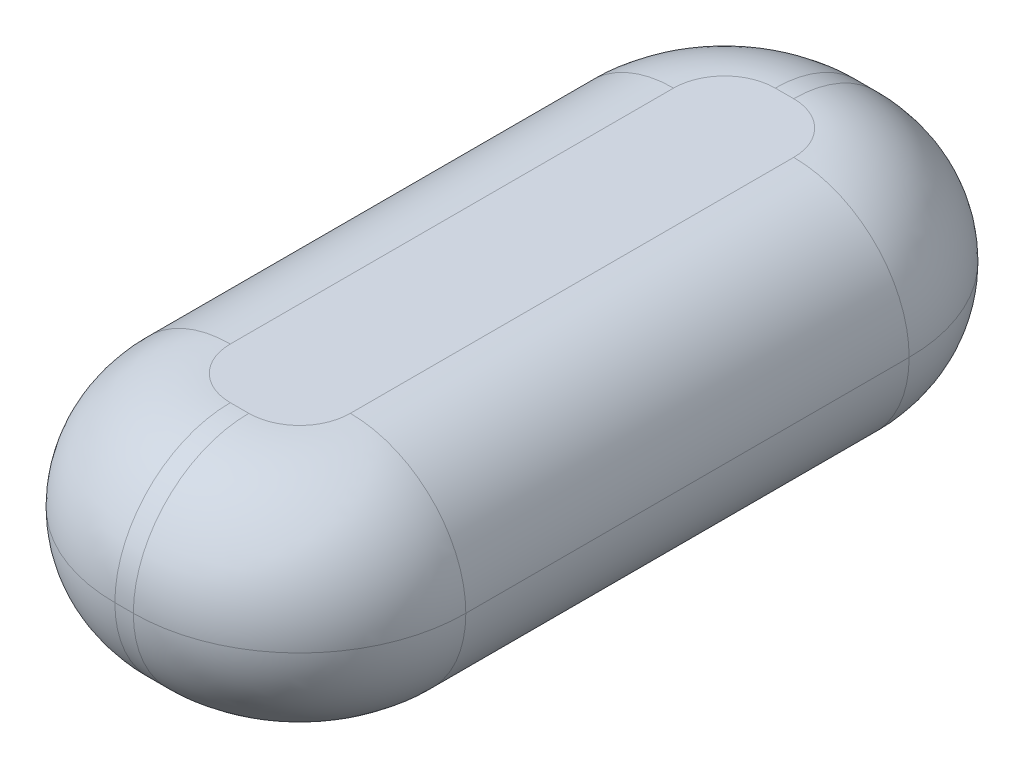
ISO-10303-21;
HEADER;
FILE_DESCRIPTION(('STEP AP214'),'2;1');
FILE_NAME('part.step','',(''),(''),'','','');
FILE_SCHEMA(('AUTOMOTIVE_DESIGN { 1 0 10303 214 1 1 1 1 }'));
ENDSEC;
DATA;
#1=APPLICATION_CONTEXT('core data for automotive mechanical design processes');
#2=APPLICATION_PROTOCOL_DEFINITION('international standard','automotive_design',2000,#1);
#3=PRODUCT_CONTEXT('',#1,'mechanical');
#4=PRODUCT('Part','Part','',(#3));
#5=PRODUCT_RELATED_PRODUCT_CATEGORY('part','',(#4));
#6=PRODUCT_DEFINITION_FORMATION('','',#4);
#7=PRODUCT_DEFINITION_CONTEXT('part definition',#1,'design');
#8=PRODUCT_DEFINITION('design','',#6,#7);
#9=PRODUCT_DEFINITION_SHAPE('','',#8);
#10=(LENGTH_UNIT() NAMED_UNIT(*) SI_UNIT(.MILLI.,.METRE.));
#11=(NAMED_UNIT(*) PLANE_ANGLE_UNIT() SI_UNIT($,.RADIAN.));
#12=(NAMED_UNIT(*) SI_UNIT($,.STERADIAN.) SOLID_ANGLE_UNIT());
#13=UNCERTAINTY_MEASURE_WITH_UNIT(LENGTH_MEASURE(1.E-05),#10,'distance_accuracy_value','');
#14=(GEOMETRIC_REPRESENTATION_CONTEXT(3) GLOBAL_UNCERTAINTY_ASSIGNED_CONTEXT((#13)) GLOBAL_UNIT_ASSIGNED_CONTEXT((#10,
#11,#12)) REPRESENTATION_CONTEXT('',''));
#15=CARTESIAN_POINT('',(0.,0.,0.));
#16=DIRECTION('',(0.,0.,1.));
#17=DIRECTION('',(1.,0.,0.));
#18=AXIS2_PLACEMENT_3D('',#15,#16,#17);
#19=CARTESIAN_POINT('',(-0.99999999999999,12.5,24.));
#20=DIRECTION('',(0.,1.,0.));
#21=DIRECTION('',(0.,0.,1.));
#22=AXIS2_PLACEMENT_3D('',#19,#20,#21);
#23=PLANE('',#22);
#24=CARTESIAN_POINT('',(-1.,12.5,-24.));
#25=DIRECTION('',(0.,1.,0.));
#26=DIRECTION('',(0.,0.,1.));
#27=AXIS2_PLACEMENT_3D('',#24,#25,#26);
#28=CIRCLE('',#27,5.49999999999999);
#29=CARTESIAN_POINT('',(-0.999999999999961,12.5,-29.5));
#30=VERTEX_POINT('',#29);
#31=CARTESIAN_POINT('',(-6.5,12.5,-23.9999999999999));
#32=VERTEX_POINT('',#31);
#33=EDGE_CURVE('E44',#30,#32,#28,.T.);
#34=ORIENTED_EDGE('',*,*,#33,.T.);
#35=DIRECTION('',(0.,0.,1.));
#36=VECTOR('',#35,1.);
#37=CARTESIAN_POINT('',(-6.49999999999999,12.5,23.9999999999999));
#38=LINE('',#37,#36);
#39=CARTESIAN_POINT('',(-6.49999999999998,12.5,23.9999999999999));
#40=VERTEX_POINT('',#39);
#41=EDGE_CURVE('E11',#32,#40,#38,.T.);
#42=ORIENTED_EDGE('',*,*,#41,.T.);
#43=CARTESIAN_POINT('',(-0.99999999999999,12.5,24.));
#44=DIRECTION('',(0.,1.,0.));
#45=DIRECTION('',(0.,0.,1.));
#46=AXIS2_PLACEMENT_3D('',#43,#44,#45);
#47=CIRCLE('',#46,5.49999999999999);
#48=CARTESIAN_POINT('',(-0.999999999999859,12.5,29.5));
#49=VERTEX_POINT('',#48);
#50=EDGE_CURVE('E211',#40,#49,#47,.T.);
#51=ORIENTED_EDGE('',*,*,#50,.T.);
#52=DIRECTION('',(1.,0.,0.));
#53=VECTOR('',#52,1.);
#54=CARTESIAN_POINT('',(0.999999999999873,12.5,29.5));
#55=LINE('',#54,#53);
#56=CARTESIAN_POINT('',(0.999999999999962,12.5,29.5));
#57=VERTEX_POINT('',#56);
#58=EDGE_CURVE('E209',#49,#57,#55,.T.);
#59=ORIENTED_EDGE('',*,*,#58,.T.);
#60=CARTESIAN_POINT('',(1.,12.5,24.));
#61=DIRECTION('',(0.,1.,0.));
#62=DIRECTION('',(0.,0.,1.));
#63=AXIS2_PLACEMENT_3D('',#60,#61,#62);
#64=CIRCLE('',#63,5.49999999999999);
#65=CARTESIAN_POINT('',(6.5,12.5,23.9999999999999));
#66=VERTEX_POINT('',#65);
#67=EDGE_CURVE('E207',#57,#66,#64,.T.);
#68=ORIENTED_EDGE('',*,*,#67,.T.);
#69=DIRECTION('',(0.,0.,-1.));
#70=VECTOR('',#69,1.);
#71=CARTESIAN_POINT('',(6.5,12.5,-23.9999999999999));
#72=LINE('',#71,#70);
#73=CARTESIAN_POINT('',(6.5,12.5,-24.));
#74=VERTEX_POINT('',#73);
#75=EDGE_CURVE('E135',#66,#74,#72,.T.);
#76=ORIENTED_EDGE('',*,*,#75,.T.);
#77=CARTESIAN_POINT('',(1.00000000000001,12.5,-24.));
#78=DIRECTION('',(0.,1.,0.));
#79=DIRECTION('',(0.,0.,1.));
#80=AXIS2_PLACEMENT_3D('',#77,#78,#79);
#81=CIRCLE('',#80,5.49999999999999);
#82=CARTESIAN_POINT('',(0.999999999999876,12.5,-29.5));
#83=VERTEX_POINT('',#82);
#84=EDGE_CURVE('E132',#74,#83,#81,.T.);
#85=ORIENTED_EDGE('',*,*,#84,.T.);
#86=DIRECTION('',(-1.,0.,0.));
#87=VECTOR('',#86,1.);
#88=CARTESIAN_POINT('',(-0.999999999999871,12.5,-29.5));
#89=LINE('',#88,#87);
#90=EDGE_CURVE('E133',#83,#30,#89,.T.);
#91=ORIENTED_EDGE('',*,*,#90,.T.);
#92=EDGE_LOOP('',(#34,#42,#51,#59,#68,#76,#85,#91));
#93=FACE_BOUND('',#92,.T.);
#94=ADVANCED_FACE('F34',(#93),#23,.T.);
#95=CARTESIAN_POINT('',(-0.99999999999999,-12.5,24.));
#96=DIRECTION('',(0.,1.,0.));
#97=DIRECTION('',(0.,0.,1.));
#98=AXIS2_PLACEMENT_3D('',#95,#96,#97);
#99=PLANE('',#98);
#100=CARTESIAN_POINT('',(1.,-12.5,24.));
#101=DIRECTION('',(0.,1.,0.));
#102=DIRECTION('',(0.,0.,1.));
#103=AXIS2_PLACEMENT_3D('',#100,#101,#102);
#104=CIRCLE('',#103,5.49999999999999);
#105=CARTESIAN_POINT('',(6.5,-12.5,24.));
#106=VERTEX_POINT('',#105);
#107=CARTESIAN_POINT('',(0.999999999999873,-12.5,29.5));
#108=VERTEX_POINT('',#107);
#109=EDGE_CURVE('E216',#106,#108,#104,.F.);
#110=ORIENTED_EDGE('',*,*,#109,.T.);
#111=DIRECTION('',(1.,0.,0.));
#112=VECTOR('',#111,1.);
#113=CARTESIAN_POINT('',(-0.99999999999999,-12.5,29.5));
#114=LINE('',#113,#112);
#115=CARTESIAN_POINT('',(-0.999999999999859,-12.5,29.5));
#116=VERTEX_POINT('',#115);
#117=EDGE_CURVE('E213',#108,#116,#114,.F.);
#118=ORIENTED_EDGE('',*,*,#117,.T.);
#119=CARTESIAN_POINT('',(-0.99999999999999,-12.5,24.));
#120=DIRECTION('',(0.,1.,0.));
#121=DIRECTION('',(0.,0.,1.));
#122=AXIS2_PLACEMENT_3D('',#119,#120,#121);
#123=CIRCLE('',#122,5.49999999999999);
#124=CARTESIAN_POINT('',(-6.49999999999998,-12.5,23.9999999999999));
#125=VERTEX_POINT('',#124);
#126=EDGE_CURVE('E146',#116,#125,#123,.F.);
#127=ORIENTED_EDGE('',*,*,#126,.T.);
#128=DIRECTION('',(0.,0.,1.));
#129=VECTOR('',#128,1.);
#130=CARTESIAN_POINT('',(-6.49999999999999,-12.5,24.));
#131=LINE('',#130,#129);
#132=CARTESIAN_POINT('',(-6.49999999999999,-12.5,-24.));
#133=VERTEX_POINT('',#132);
#134=EDGE_CURVE('E226',#125,#133,#131,.F.);
#135=ORIENTED_EDGE('',*,*,#134,.T.);
#136=CARTESIAN_POINT('',(-1.,-12.5,-24.));
#137=DIRECTION('',(0.,1.,0.));
#138=DIRECTION('',(0.,0.,1.));
#139=AXIS2_PLACEMENT_3D('',#136,#137,#138);
#140=CIRCLE('',#139,5.49999999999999);
#141=CARTESIAN_POINT('',(-0.999999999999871,-12.5,-29.5));
#142=VERTEX_POINT('',#141);
#143=EDGE_CURVE('E224',#133,#142,#140,.F.);
#144=ORIENTED_EDGE('',*,*,#143,.T.);
#145=DIRECTION('',(-1.,0.,0.));
#146=VECTOR('',#145,1.);
#147=CARTESIAN_POINT('',(-0.99999999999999,-12.5,-29.5));
#148=LINE('',#147,#146);
#149=CARTESIAN_POINT('',(0.999999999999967,-12.5,-29.5));
#150=VERTEX_POINT('',#149);
#151=EDGE_CURVE('E222',#142,#150,#148,.F.);
#152=ORIENTED_EDGE('',*,*,#151,.T.);
#153=CARTESIAN_POINT('',(1.00000000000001,-12.5,-24.));
#154=DIRECTION('',(0.,1.,0.));
#155=DIRECTION('',(0.,0.,1.));
#156=AXIS2_PLACEMENT_3D('',#153,#154,#155);
#157=CIRCLE('',#156,5.49999999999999);
#158=CARTESIAN_POINT('',(6.5,-12.5,-23.9999999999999));
#159=VERTEX_POINT('',#158);
#160=EDGE_CURVE('E220',#150,#159,#157,.F.);
#161=ORIENTED_EDGE('',*,*,#160,.T.);
#162=DIRECTION('',(0.,0.,-1.));
#163=VECTOR('',#162,1.);
#164=CARTESIAN_POINT('',(6.5,-12.5,24.));
#165=LINE('',#164,#163);
#166=EDGE_CURVE('E218',#159,#106,#165,.F.);
#167=ORIENTED_EDGE('',*,*,#166,.T.);
#168=EDGE_LOOP('',(#110,#118,#127,#135,#144,#152,#161,#167));
#169=FACE_BOUND('',#168,.T.);
#170=ADVANCED_FACE('F230',(#169),#99,.F.);
#171=CARTESIAN_POINT('',(-0.99999999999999,0.,-29.5));
#172=DIRECTION('',(1.,0.,0.));
#173=DIRECTION('',(0.,0.,-1.));
#174=AXIS2_PLACEMENT_3D('',#171,#172,#173);
#175=CYLINDRICAL_SURFACE('',#174,12.5);
#176=CARTESIAN_POINT('',(-0.999999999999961,0.,-29.5));
#177=DIRECTION('',(-1.,0.,0.));
#178=DIRECTION('',(0.,0.,1.));
#179=AXIS2_PLACEMENT_3D('',#176,#177,#178);
#180=CIRCLE('',#179,12.5);
#181=CARTESIAN_POINT('',(-0.999999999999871,0.,-42.));
#182=VERTEX_POINT('',#181);
#183=EDGE_CURVE('E38',#30,#182,#180,.T.);
#184=ORIENTED_EDGE('',*,*,#183,.F.);
#185=ORIENTED_EDGE('',*,*,#90,.F.);
#186=CARTESIAN_POINT('',(0.999999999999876,0.,-29.5));
#187=DIRECTION('',(1.,0.,0.));
#188=DIRECTION('',(0.,0.,-1.));
#189=AXIS2_PLACEMENT_3D('',#186,#187,#188);
#190=CIRCLE('',#189,12.5);
#191=CARTESIAN_POINT('',(0.999999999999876,0.,-42.));
#192=VERTEX_POINT('',#191);
#193=EDGE_CURVE('E80',#192,#83,#190,.T.);
#194=ORIENTED_EDGE('',*,*,#193,.F.);
#195=DIRECTION('',(-1.,0.,0.));
#196=VECTOR('',#195,1.);
#197=CARTESIAN_POINT('',(0.999999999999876,0.,-42.));
#198=LINE('',#197,#196);
#199=EDGE_CURVE('E145',#182,#192,#198,.F.);
#200=ORIENTED_EDGE('',*,*,#199,.F.);
#201=EDGE_LOOP('',(#184,#185,#194,#200));
#202=FACE_BOUND('',#201,.T.);
#203=ADVANCED_FACE('F36',(#202),#175,.T.);
#204=CARTESIAN_POINT('',(-1.,0.,-24.));
#205=DIRECTION('',(0.,1.,0.));
#206=DIRECTION('',(0.,0.,1.));
#207=AXIS2_PLACEMENT_3D('',#204,#205,#206);
#208=DEGENERATE_TOROIDAL_SURFACE('',#207,5.49999999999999,12.5,.T.);
#209=ORIENTED_EDGE('',*,*,#33,.F.);
#210=ORIENTED_EDGE('',*,*,#183,.T.);
#211=CARTESIAN_POINT('',(-1.,0.,-24.));
#212=DIRECTION('',(0.,1.,0.));
#213=DIRECTION('',(0.,0.,1.));
#214=AXIS2_PLACEMENT_3D('',#211,#212,#213);
#215=CIRCLE('',#214,18.);
#216=CARTESIAN_POINT('',(-19.,0.,-23.9999999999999));
#217=VERTEX_POINT('',#216);
#218=EDGE_CURVE('E152',#217,#182,#215,.F.);
#219=ORIENTED_EDGE('',*,*,#218,.F.);
#220=CARTESIAN_POINT('',(-6.5,0.,-23.9999999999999));
#221=DIRECTION('',(0.,0.,1.));
#222=DIRECTION('',(1.,0.,0.));
#223=AXIS2_PLACEMENT_3D('',#220,#221,#222);
#224=CIRCLE('',#223,12.5);
#225=EDGE_CURVE('E155',#32,#217,#224,.T.);
#226=ORIENTED_EDGE('',*,*,#225,.F.);
#227=EDGE_LOOP('',(#209,#210,#219,#226));
#228=FACE_BOUND('',#227,.T.);
#229=ADVANCED_FACE('F269',(#228),#208,.T.);
#230=CARTESIAN_POINT('',(1.00000000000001,0.,-24.));
#231=DIRECTION('',(0.,1.,0.));
#232=DIRECTION('',(0.,0.,1.));
#233=AXIS2_PLACEMENT_3D('',#230,#231,#232);
#234=DEGENERATE_TOROIDAL_SURFACE('',#233,5.49999999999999,12.5,.T.);
#235=ORIENTED_EDGE('',*,*,#193,.T.);
#236=ORIENTED_EDGE('',*,*,#84,.F.);
#237=CARTESIAN_POINT('',(6.5,0.,-24.));
#238=DIRECTION('',(0.,0.,1.));
#239=DIRECTION('',(1.,0.,0.));
#240=AXIS2_PLACEMENT_3D('',#237,#238,#239);
#241=CIRCLE('',#240,12.5);
#242=CARTESIAN_POINT('',(19.,0.,-23.9999999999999));
#243=VERTEX_POINT('',#242);
#244=EDGE_CURVE('E158',#243,#74,#241,.T.);
#245=ORIENTED_EDGE('',*,*,#244,.F.);
#246=CARTESIAN_POINT('',(1.00000000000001,0.,-24.));
#247=DIRECTION('',(0.,1.,0.));
#248=DIRECTION('',(0.,0.,1.));
#249=AXIS2_PLACEMENT_3D('',#246,#247,#248);
#250=CIRCLE('',#249,18.);
#251=EDGE_CURVE('E143',#192,#243,#250,.F.);
#252=ORIENTED_EDGE('',*,*,#251,.F.);
#253=EDGE_LOOP('',(#235,#236,#245,#252));
#254=FACE_BOUND('',#253,.T.);
#255=ADVANCED_FACE('F141',(#254),#234,.T.);
#256=CARTESIAN_POINT('',(-0.999999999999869,0.,-29.5));
#257=DIRECTION('',(-1.,0.,0.));
#258=DIRECTION('',(0.,0.,1.));
#259=AXIS2_PLACEMENT_3D('',#256,#257,#258);
#260=CYLINDRICAL_SURFACE('',#259,12.5);
#261=CARTESIAN_POINT('',(0.999999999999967,0.,-29.5));
#262=DIRECTION('',(1.,0.,0.));
#263=DIRECTION('',(0.,0.,-1.));
#264=AXIS2_PLACEMENT_3D('',#261,#262,#263);
#265=CIRCLE('',#264,12.5);
#266=EDGE_CURVE('E161',#150,#192,#265,.T.);
#267=ORIENTED_EDGE('',*,*,#266,.F.);
#268=ORIENTED_EDGE('',*,*,#151,.F.);
#269=CARTESIAN_POINT('',(-0.999999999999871,0.,-29.5));
#270=DIRECTION('',(-1.,0.,0.));
#271=DIRECTION('',(0.,0.,1.));
#272=AXIS2_PLACEMENT_3D('',#269,#270,#271);
#273=CIRCLE('',#272,12.5);
#274=EDGE_CURVE('E147',#182,#142,#273,.T.);
#275=ORIENTED_EDGE('',*,*,#274,.F.);
#276=ORIENTED_EDGE('',*,*,#199,.T.);
#277=EDGE_LOOP('',(#267,#268,#275,#276));
#278=FACE_BOUND('',#277,.T.);
#279=ADVANCED_FACE('F265',(#278),#260,.T.);
#280=CARTESIAN_POINT('',(-1.,0.,-24.));
#281=DIRECTION('',(0.,1.,0.));
#282=DIRECTION('',(0.,0.,1.));
#283=AXIS2_PLACEMENT_3D('',#280,#281,#282);
#284=DEGENERATE_TOROIDAL_SURFACE('',#283,5.49999999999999,12.5,.T.);
#285=ORIENTED_EDGE('',*,*,#274,.T.);
#286=ORIENTED_EDGE('',*,*,#143,.F.);
#287=CARTESIAN_POINT('',(-6.5,0.,-24.));
#288=DIRECTION('',(0.,0.,1.));
#289=DIRECTION('',(1.,0.,0.));
#290=AXIS2_PLACEMENT_3D('',#287,#288,#289);
#291=CIRCLE('',#290,12.5);
#292=EDGE_CURVE('E163',#217,#133,#291,.T.);
#293=ORIENTED_EDGE('',*,*,#292,.F.);
#294=ORIENTED_EDGE('',*,*,#218,.T.);
#295=EDGE_LOOP('',(#285,#286,#293,#294));
#296=FACE_BOUND('',#295,.T.);
#297=ADVANCED_FACE('F268',(#296),#284,.T.);
#298=CARTESIAN_POINT('',(-6.49999999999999,0.,24.));
#299=DIRECTION('',(0.,0.,-1.));
#300=DIRECTION('',(-1.,0.,0.));
#301=AXIS2_PLACEMENT_3D('',#298,#299,#300);
#302=CYLINDRICAL_SURFACE('',#301,12.5);
#303=ORIENTED_EDGE('',*,*,#41,.F.);
#304=ORIENTED_EDGE('',*,*,#225,.T.);
#305=DIRECTION('',(0.,0.,1.));
#306=VECTOR('',#305,1.);
#307=CARTESIAN_POINT('',(-19.,0.,-23.9999999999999));
#308=LINE('',#307,#306);
#309=CARTESIAN_POINT('',(-19.,0.,23.9999999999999));
#310=VERTEX_POINT('',#309);
#311=EDGE_CURVE('E166',#310,#217,#308,.F.);
#312=ORIENTED_EDGE('',*,*,#311,.F.);
#313=CARTESIAN_POINT('',(-6.49999999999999,0.,23.9999999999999));
#314=DIRECTION('',(0.,0.,1.));
#315=DIRECTION('',(1.,0.,0.));
#316=AXIS2_PLACEMENT_3D('',#313,#314,#315);
#317=CIRCLE('',#316,12.5);
#318=EDGE_CURVE('E169',#40,#310,#317,.T.);
#319=ORIENTED_EDGE('',*,*,#318,.F.);
#320=EDGE_LOOP('',(#303,#304,#312,#319));
#321=FACE_BOUND('',#320,.T.);
#322=ADVANCED_FACE('F272',(#321),#302,.T.);
#323=CARTESIAN_POINT('',(6.5,0.,24.));
#324=DIRECTION('',(0.,0.,1.));
#325=DIRECTION('',(1.,0.,0.));
#326=AXIS2_PLACEMENT_3D('',#323,#324,#325);
#327=CYLINDRICAL_SURFACE('',#326,12.5);
#328=ORIENTED_EDGE('',*,*,#244,.T.);
#329=ORIENTED_EDGE('',*,*,#75,.F.);
#330=CARTESIAN_POINT('',(6.5,0.,23.9999999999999));
#331=DIRECTION('',(0.,0.,1.));
#332=DIRECTION('',(1.,0.,0.));
#333=AXIS2_PLACEMENT_3D('',#330,#331,#332);
#334=CIRCLE('',#333,12.5);
#335=CARTESIAN_POINT('',(19.,0.,23.9999999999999));
#336=VERTEX_POINT('',#335);
#337=EDGE_CURVE('E172',#336,#66,#334,.T.);
#338=ORIENTED_EDGE('',*,*,#337,.F.);
#339=DIRECTION('',(0.,0.,-1.));
#340=VECTOR('',#339,1.);
#341=CARTESIAN_POINT('',(19.,0.,23.9999999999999));
#342=LINE('',#341,#340);
#343=EDGE_CURVE('E175',#243,#336,#342,.F.);
#344=ORIENTED_EDGE('',*,*,#343,.F.);
#345=EDGE_LOOP('',(#328,#329,#338,#344));
#346=FACE_BOUND('',#345,.T.);
#347=ADVANCED_FACE('F252',(#346),#327,.T.);
#348=CARTESIAN_POINT('',(1.00000000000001,0.,-24.));
#349=DIRECTION('',(0.,1.,0.));
#350=DIRECTION('',(0.,0.,1.));
#351=AXIS2_PLACEMENT_3D('',#348,#349,#350);
#352=DEGENERATE_TOROIDAL_SURFACE('',#351,5.49999999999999,12.5,.T.);
#353=ORIENTED_EDGE('',*,*,#266,.T.);
#354=ORIENTED_EDGE('',*,*,#251,.T.);
#355=CARTESIAN_POINT('',(6.5,0.,-23.9999999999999));
#356=DIRECTION('',(0.,0.,1.));
#357=DIRECTION('',(1.,0.,0.));
#358=AXIS2_PLACEMENT_3D('',#355,#356,#357);
#359=CIRCLE('',#358,12.5);
#360=EDGE_CURVE('E178',#159,#243,#359,.T.);
#361=ORIENTED_EDGE('',*,*,#360,.F.);
#362=ORIENTED_EDGE('',*,*,#160,.F.);
#363=EDGE_LOOP('',(#353,#354,#361,#362));
#364=FACE_BOUND('',#363,.T.);
#365=ADVANCED_FACE('F261',(#364),#352,.T.);
#366=CARTESIAN_POINT('',(-6.49999999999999,0.,-23.9999999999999));
#367=DIRECTION('',(0.,0.,1.));
#368=DIRECTION('',(1.,0.,0.));
#369=AXIS2_PLACEMENT_3D('',#366,#367,#368);
#370=CYLINDRICAL_SURFACE('',#369,12.5);
#371=ORIENTED_EDGE('',*,*,#292,.T.);
#372=ORIENTED_EDGE('',*,*,#134,.F.);
#373=CARTESIAN_POINT('',(-6.49999999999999,0.,23.9999999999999));
#374=DIRECTION('',(0.,0.,1.));
#375=DIRECTION('',(1.,0.,0.));
#376=AXIS2_PLACEMENT_3D('',#373,#374,#375);
#377=CIRCLE('',#376,12.5);
#378=EDGE_CURVE('E181',#310,#125,#377,.T.);
#379=ORIENTED_EDGE('',*,*,#378,.F.);
#380=ORIENTED_EDGE('',*,*,#311,.T.);
#381=EDGE_LOOP('',(#371,#372,#379,#380));
#382=FACE_BOUND('',#381,.T.);
#383=ADVANCED_FACE('F235',(#382),#370,.T.);
#384=CARTESIAN_POINT('',(-0.99999999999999,0.,24.));
#385=DIRECTION('',(0.,1.,0.));
#386=DIRECTION('',(0.,0.,1.));
#387=AXIS2_PLACEMENT_3D('',#384,#385,#386);
#388=DEGENERATE_TOROIDAL_SURFACE('',#387,5.49999999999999,12.5,.T.);
#389=ORIENTED_EDGE('',*,*,#50,.F.);
#390=ORIENTED_EDGE('',*,*,#318,.T.);
#391=CARTESIAN_POINT('',(-0.99999999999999,0.,24.));
#392=DIRECTION('',(0.,1.,0.));
#393=DIRECTION('',(0.,0.,1.));
#394=AXIS2_PLACEMENT_3D('',#391,#392,#393);
#395=CIRCLE('',#394,18.);
#396=CARTESIAN_POINT('',(-0.999999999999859,0.,42.));
#397=VERTEX_POINT('',#396);
#398=EDGE_CURVE('E184',#397,#310,#395,.F.);
#399=ORIENTED_EDGE('',*,*,#398,.F.);
#400=CARTESIAN_POINT('',(-0.999999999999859,0.,29.5));
#401=DIRECTION('',(1.,0.,0.));
#402=DIRECTION('',(0.,0.,-1.));
#403=AXIS2_PLACEMENT_3D('',#400,#401,#402);
#404=CIRCLE('',#403,12.5);
#405=EDGE_CURVE('E187',#49,#397,#404,.T.);
#406=ORIENTED_EDGE('',*,*,#405,.F.);
#407=EDGE_LOOP('',(#389,#390,#399,#406));
#408=FACE_BOUND('',#407,.T.);
#409=ADVANCED_FACE('F240',(#408),#388,.T.);
#410=CARTESIAN_POINT('',(1.,0.,24.));
#411=DIRECTION('',(0.,1.,0.));
#412=DIRECTION('',(0.,0.,1.));
#413=AXIS2_PLACEMENT_3D('',#410,#411,#412);
#414=DEGENERATE_TOROIDAL_SURFACE('',#413,5.49999999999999,12.5,.T.);
#415=ORIENTED_EDGE('',*,*,#337,.T.);
#416=ORIENTED_EDGE('',*,*,#67,.F.);
#417=CARTESIAN_POINT('',(0.999999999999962,0.,29.5));
#418=DIRECTION('',(-1.,0.,0.));
#419=DIRECTION('',(0.,0.,1.));
#420=AXIS2_PLACEMENT_3D('',#417,#418,#419);
#421=CIRCLE('',#420,12.5);
#422=CARTESIAN_POINT('',(0.999999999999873,0.,42.));
#423=VERTEX_POINT('',#422);
#424=EDGE_CURVE('E190',#423,#57,#421,.T.);
#425=ORIENTED_EDGE('',*,*,#424,.F.);
#426=CARTESIAN_POINT('',(1.,0.,24.));
#427=DIRECTION('',(0.,1.,0.));
#428=DIRECTION('',(0.,0.,1.));
#429=AXIS2_PLACEMENT_3D('',#426,#427,#428);
#430=CIRCLE('',#429,18.);
#431=EDGE_CURVE('E193',#336,#423,#430,.F.);
#432=ORIENTED_EDGE('',*,*,#431,.F.);
#433=EDGE_LOOP('',(#415,#416,#425,#432));
#434=FACE_BOUND('',#433,.T.);
#435=ADVANCED_FACE('F248',(#434),#414,.T.);
#436=CARTESIAN_POINT('',(6.5,0.,-23.9999999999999));
#437=DIRECTION('',(0.,0.,-1.));
#438=DIRECTION('',(-1.,0.,0.));
#439=AXIS2_PLACEMENT_3D('',#436,#437,#438);
#440=CYLINDRICAL_SURFACE('',#439,12.5);
#441=ORIENTED_EDGE('',*,*,#360,.T.);
#442=ORIENTED_EDGE('',*,*,#343,.T.);
#443=CARTESIAN_POINT('',(6.5,0.,24.));
#444=DIRECTION('',(0.,0.,1.));
#445=DIRECTION('',(1.,0.,0.));
#446=AXIS2_PLACEMENT_3D('',#443,#444,#445);
#447=CIRCLE('',#446,12.5);
#448=EDGE_CURVE('E196',#106,#336,#447,.T.);
#449=ORIENTED_EDGE('',*,*,#448,.F.);
#450=ORIENTED_EDGE('',*,*,#166,.F.);
#451=EDGE_LOOP('',(#441,#442,#449,#450));
#452=FACE_BOUND('',#451,.T.);
#453=ADVANCED_FACE('F255',(#452),#440,.T.);
#454=CARTESIAN_POINT('',(-0.99999999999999,0.,24.));
#455=DIRECTION('',(0.,1.,0.));
#456=DIRECTION('',(0.,0.,1.));
#457=AXIS2_PLACEMENT_3D('',#454,#455,#456);
#458=DEGENERATE_TOROIDAL_SURFACE('',#457,5.49999999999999,12.5,.T.);
#459=ORIENTED_EDGE('',*,*,#378,.T.);
#460=ORIENTED_EDGE('',*,*,#126,.F.);
#461=CARTESIAN_POINT('',(-0.99999999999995,0.,29.5));
#462=DIRECTION('',(1.,0.,0.));
#463=DIRECTION('',(0.,0.,-1.));
#464=AXIS2_PLACEMENT_3D('',#461,#462,#463);
#465=CIRCLE('',#464,12.5);
#466=EDGE_CURVE('E93',#397,#116,#465,.T.);
#467=ORIENTED_EDGE('',*,*,#466,.F.);
#468=ORIENTED_EDGE('',*,*,#398,.T.);
#469=EDGE_LOOP('',(#459,#460,#467,#468));
#470=FACE_BOUND('',#469,.T.);
#471=ADVANCED_FACE('F237',(#470),#458,.T.);
#472=CARTESIAN_POINT('',(-0.99999999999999,0.,29.5));
#473=DIRECTION('',(-1.,0.,0.));
#474=DIRECTION('',(0.,0.,1.));
#475=AXIS2_PLACEMENT_3D('',#472,#473,#474);
#476=CYLINDRICAL_SURFACE('',#475,12.5);
#477=ORIENTED_EDGE('',*,*,#58,.F.);
#478=ORIENTED_EDGE('',*,*,#405,.T.);
#479=DIRECTION('',(1.,0.,0.));
#480=VECTOR('',#479,1.);
#481=CARTESIAN_POINT('',(-0.999999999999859,0.,42.));
#482=LINE('',#481,#480);
#483=EDGE_CURVE('E200',#423,#397,#482,.F.);
#484=ORIENTED_EDGE('',*,*,#483,.F.);
#485=ORIENTED_EDGE('',*,*,#424,.T.);
#486=EDGE_LOOP('',(#477,#478,#484,#485));
#487=FACE_BOUND('',#486,.T.);
#488=ADVANCED_FACE('F245',(#487),#476,.T.);
#489=CARTESIAN_POINT('',(1.,0.,24.));
#490=DIRECTION('',(0.,1.,0.));
#491=DIRECTION('',(0.,0.,1.));
#492=AXIS2_PLACEMENT_3D('',#489,#490,#491);
#493=DEGENERATE_TOROIDAL_SURFACE('',#492,5.49999999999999,12.5,.T.);
#494=ORIENTED_EDGE('',*,*,#448,.T.);
#495=ORIENTED_EDGE('',*,*,#431,.T.);
#496=CARTESIAN_POINT('',(0.999999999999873,0.,29.5));
#497=DIRECTION('',(-1.,0.,0.));
#498=DIRECTION('',(0.,0.,1.));
#499=AXIS2_PLACEMENT_3D('',#496,#497,#498);
#500=CIRCLE('',#499,12.5);
#501=EDGE_CURVE('E202',#108,#423,#500,.T.);
#502=ORIENTED_EDGE('',*,*,#501,.F.);
#503=ORIENTED_EDGE('',*,*,#109,.F.);
#504=EDGE_LOOP('',(#494,#495,#502,#503));
#505=FACE_BOUND('',#504,.T.);
#506=ADVANCED_FACE('F291',(#505),#493,.T.);
#507=CARTESIAN_POINT('',(-0.999999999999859,0.,29.5));
#508=DIRECTION('',(1.,0.,0.));
#509=DIRECTION('',(0.,0.,-1.));
#510=AXIS2_PLACEMENT_3D('',#507,#508,#509);
#511=CYLINDRICAL_SURFACE('',#510,12.5);
#512=ORIENTED_EDGE('',*,*,#466,.T.);
#513=ORIENTED_EDGE('',*,*,#117,.F.);
#514=ORIENTED_EDGE('',*,*,#501,.T.);
#515=ORIENTED_EDGE('',*,*,#483,.T.);
#516=EDGE_LOOP('',(#512,#513,#514,#515));
#517=FACE_BOUND('',#516,.T.);
#518=ADVANCED_FACE('F288',(#517),#511,.T.);
#519=CLOSED_SHELL('',(#94,#170,#203,#229,#255,#279,#297,#322,#347,#365,#383,#409,#435,#453,#471,
#488,#506,#518));
#520=MANIFOLD_SOLID_BREP('B2',#519);
#521=ADVANCED_BREP_SHAPE_REPRESENTATION('',(#18,#520),#14);
#522=SHAPE_DEFINITION_REPRESENTATION(#9,#521);
ENDSEC;
END-ISO-10303-21;
